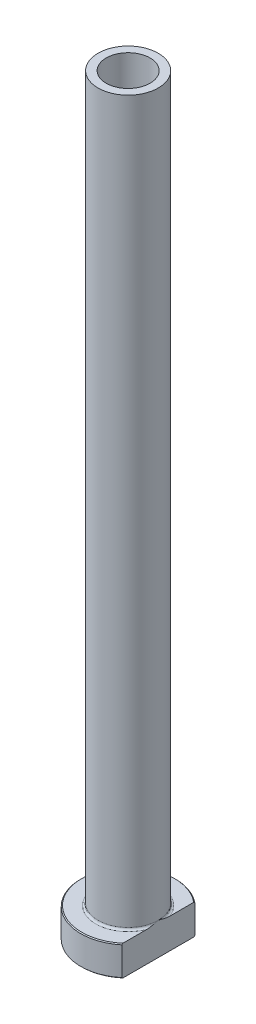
from build123d import *

# Parameters (mm, degrees)
FILLET1_R          = 0.5
CHAMFER1_SIZE      = 0.2
CUT_EXTRUDE1_DEPTH = 176.690068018
CHAMFER2_SIZE      = 0.5


with BuildPart() as part:
    # Sketch1 → Revolve1 (revolve)
    with BuildSketch(Plane.XY, mode=Mode.PRIVATE) as revolve1_sk:
        Polygon((-5.1, 175), (-7, 175), (-7, 7), (-11, 7), (-11, 0), (-5.35, 0), (-5.35, 108), (-5.1, 120), align=None)
    revolve(revolve1_sk.sketch.rotate(Axis((0, 92.187680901, 0), (0, -1, 0)), 270), axis=Axis((0, 92.187680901, 0), (0, -1, 0)))

    # Fillet1
    fillet1_edges = [part.edges().sort_by_distance(p)[0] for p in [
        (0, 7, -7),
    ]]
    fillet(fillet1_edges, radius=FILLET1_R)

    # Chamfer1
    chamfer1_edges = [part.edges().sort_by_distance(p)[0] for p in [
        (0, 0, -11),
        (0, 7, -11),
    ]]
    chamfer(chamfer1_edges, length=CHAMFER1_SIZE)

    # Sketch2 → Cut-Extrude1 (cut, through all)
    with BuildSketch(Plane.XZ):
        with BuildLine():
            Line((7, 8.485281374), (7, -8.485281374))
            ThreePointArc((7, -8.485281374), (11, 0), (7, 8.485281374))
        make_face()
    extrude(amount=-CUT_EXTRUDE1_DEPTH, mode=Mode.SUBTRACT)

    # Chamfer2
    chamfer2_edges = [part.edges().sort_by_distance(p)[0] for p in [
        (0, 0, -5.35),
    ]]
    chamfer(chamfer2_edges, length=CHAMFER2_SIZE)


solid = part.part
